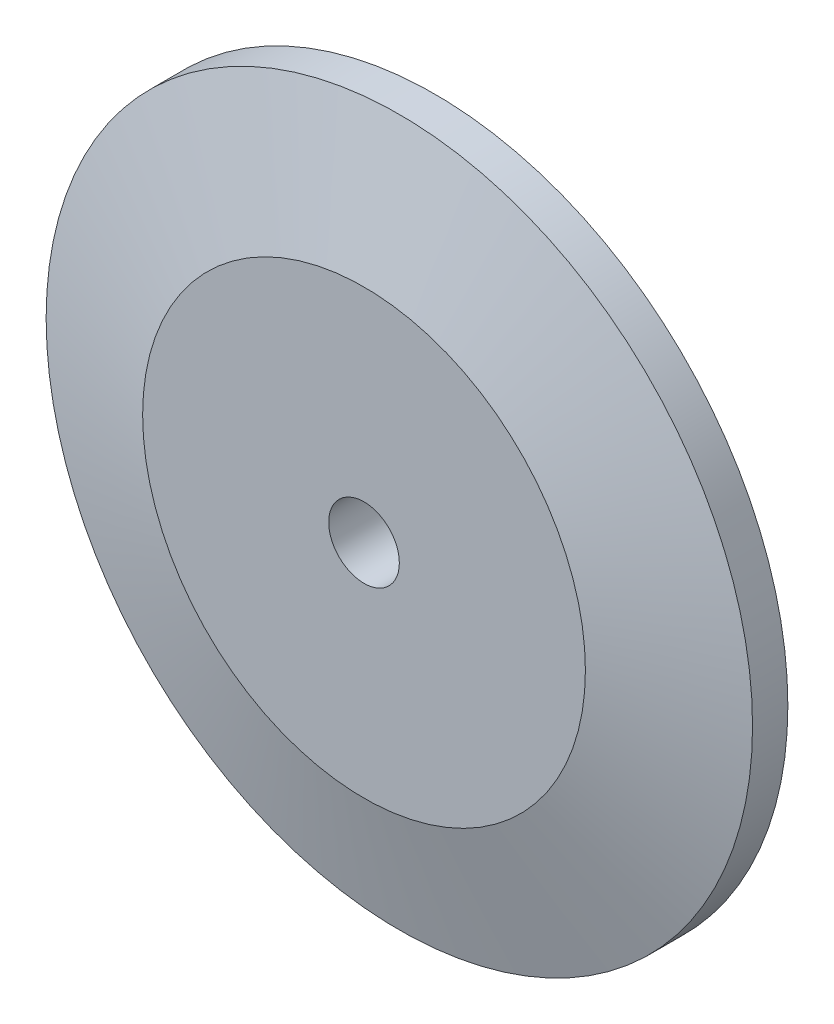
from build123d import *

# Parameters (mm, degrees)
SKETCH1_R           = 25.4
BOSS_EXTRUDE2_DEPTH = 2.54
SKETCH2_R           = 25.4
BOSS_EXTRUDE3_DEPTH = 2.54
BOSS_EXTRUDE3_TAPER = 75
SKETCH3_R           = 2.54
BOSS_EXTRUDE4_DEPTH = 8.89
SKETCH4_R           = 2.54
BOSS_EXTRUDE5_DEPTH = 2.54
CUT_EXTRUDE1_START  = -11.43
SKETCH5_R           = 2.54
CUT_EXTRUDE1_DEPTH  = 11.43
SKETCH6_R           = 2.54
CUT_EXTRUDE2_DEPTH  = 14.224


with BuildPart() as part:
    # Sketch1 → Boss-Extrude2 (new body)
    with BuildSketch(Plane.XY):
        Circle(SKETCH1_R)
    extrude(amount=BOSS_EXTRUDE2_DEPTH)

    # Sketch2 → Boss-Extrude3 (add)
    with BuildSketch(Plane.XY.offset(2.54)):
        Circle(SKETCH2_R)
    extrude(amount=BOSS_EXTRUDE3_DEPTH, taper=BOSS_EXTRUDE3_TAPER)

    # Sketch3 → Boss-Extrude4 (add)
    with BuildSketch(Plane(origin=(0, 0, 0), x_dir=(-1, 0, 0), z_dir=(0, 0, -1))):
        with Locations(Location((0, 0, 0), (0, 0, 180))):
            Circle(SKETCH3_R)
    extrude(amount=BOSS_EXTRUDE4_DEPTH)

    # Sketch4 → Boss-Extrude5 (add)
    with BuildSketch(Plane(origin=(0, 0, -8.89), x_dir=(-1, 0, 0), z_dir=(0, 0, -1))):
        with Locations(Location((0, 0, 0), (0, 0, 180))):
            Circle(SKETCH4_R)
    extrude(amount=BOSS_EXTRUDE5_DEPTH)

    # Sketch5 → Cut-Extrude1 (cut)
    with BuildSketch(Plane(origin=(0, 0, -11.43), x_dir=(-1, 0, 0), z_dir=(0, 0, -1)).offset(CUT_EXTRUDE1_START)):
        Circle(SKETCH5_R)
    extrude(amount=CUT_EXTRUDE1_DEPTH, mode=Mode.SUBTRACT)

    # Sketch6 → Cut-Extrude2 (cut)
    with BuildSketch(Plane.XY.offset(5.08)):
        Circle(SKETCH6_R)
    extrude(amount=-CUT_EXTRUDE2_DEPTH, mode=Mode.SUBTRACT)


solid = part.part
